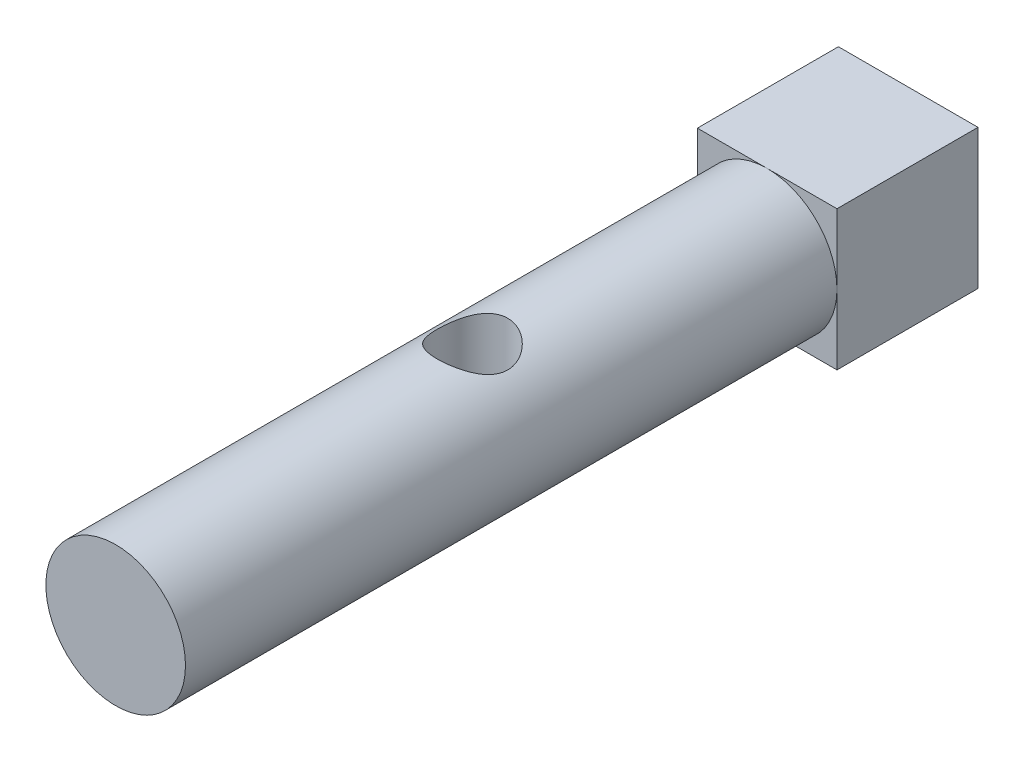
from build123d import *

# Parameters (mm, degrees)
SKETCH1_R                           = 4.95
BOSS_EXTRUDE1_DEPTH                 = 46.2
SKETCH2_W                           = 9.9
SKETCH2_H                           = 9.9
BOSS_EXTRUDE2_DEPTH                 = 10
CUT_EXTRUDE1_REACH                  = 48.727
CUT_EXTRUDE1_END_RADIUS             = 4.95
SKETCH3_R                           = 2.5
CUT_EXTRUDE1_DIRECTION_2_REACH      = 48.727
CUT_EXTRUDE1_DIRECTION_2_END_RADIUS = 4.95


with BuildPart() as part:
    # Sketch1 → Boss-Extrude1 (new body)
    with BuildSketch(Plane.XY):
        Circle(SKETCH1_R)
    extrude(amount=BOSS_EXTRUDE1_DEPTH)

    # Sketch2 → Boss-Extrude2 (add)
    with BuildSketch(Plane(origin=(0, 0, 0), x_dir=(-1, 0, 0), z_dir=(0, 0, -1))):
        Rectangle(SKETCH2_W, SKETCH2_H)
    extrude(amount=BOSS_EXTRUDE2_DEPTH)

    # Cut-Extrude1: up to this cylinder (the profile starts inside it)
    cut_extrude1_end = Plane(origin=(0, 0, 20.9), z_dir=(0, 0, -1)) * Cylinder(CUT_EXTRUDE1_END_RADIUS, 108.354, mode=Mode.PRIVATE)
    # Sketch3 → Cut-Extrude1 (cut, up to the surface)
    with BuildSketch(Plane(origin=(0, 0, 0), x_dir=(1, 0, 0), z_dir=(0, 1, 0)), mode=Mode.PRIVATE) as cut_extrude1_sk1:
        with Locations(Location((0, -20.9, 0), (0, 0, 90))):
            Circle(SKETCH3_R)
    cut_extrude1_tool1 = extrude(cut_extrude1_sk1.sketch, amount=-CUT_EXTRUDE1_REACH, mode=Mode.PRIVATE) & cut_extrude1_end
    add(cut_extrude1_tool1.solids().sort_by_distance((0, 0, 20.9))[0], mode=Mode.SUBTRACT)

    # Cut-Extrude1 direction 2: up to this cylinder (the profile starts inside it)
    cut_extrude1_direction_2_end = Plane(origin=(0, 0, 20.9), z_dir=(0, 0, -1)) * Cylinder(CUT_EXTRUDE1_DIRECTION_2_END_RADIUS, 108.354, mode=Mode.PRIVATE)
    # Sketch3 → Cut-Extrude1 direction 2 (cut, up to the surface)
    with BuildSketch(Plane(origin=(0, 0, 0), x_dir=(1, 0, 0), z_dir=(0, 1, 0)), mode=Mode.PRIVATE) as cut_extrude1_direction_2_sk1:
        with Locations(Location((0, -20.9, 0), (0, 0, 90))):
            Circle(SKETCH3_R)
    cut_extrude1_direction_2_tool1 = extrude(cut_extrude1_direction_2_sk1.sketch, amount=CUT_EXTRUDE1_DIRECTION_2_REACH, mode=Mode.PRIVATE) & cut_extrude1_direction_2_end
    add(cut_extrude1_direction_2_tool1.solids().sort_by_distance((0, 0, 20.9))[0], mode=Mode.SUBTRACT)


solid = part.part
